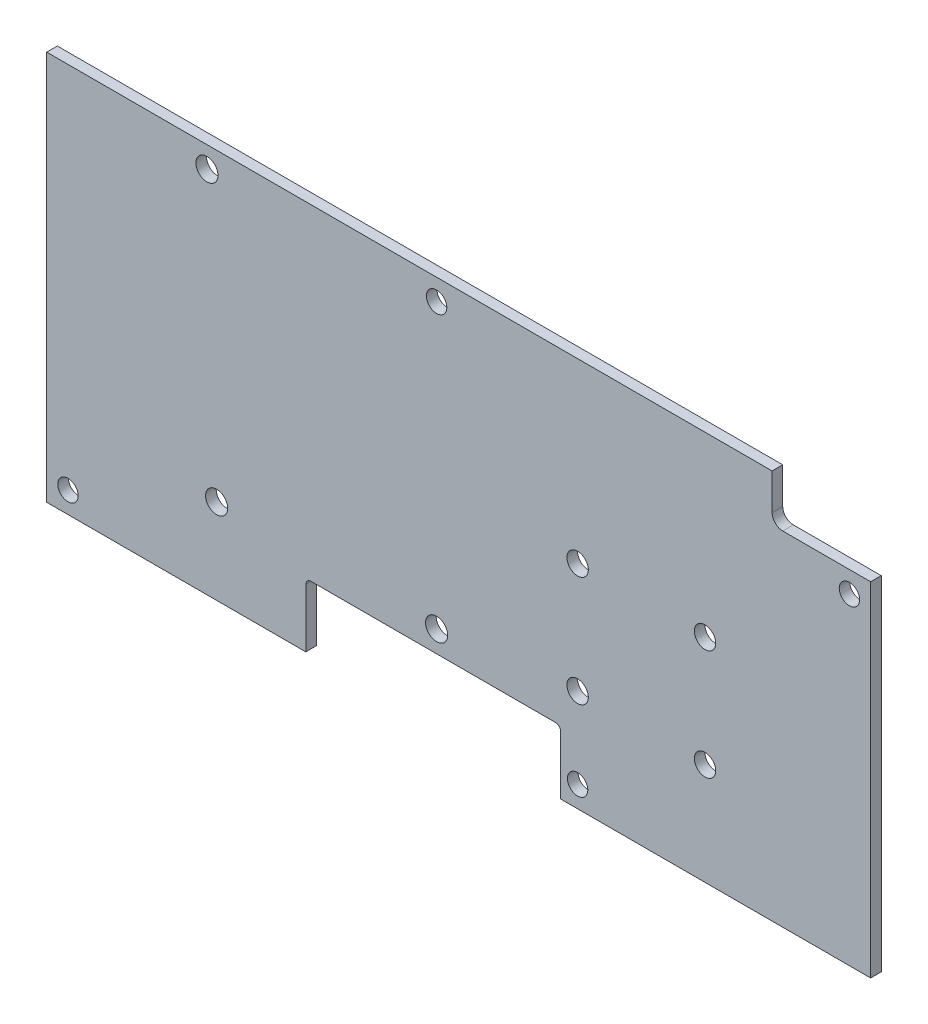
from build123d import *

# Parameters (mm, degrees)
SKETCH1_W               = 167.64
SKETCH1_H               = 165.1
PCB_DEPTH               = 1.5875
SKETCH4_R               = 1.524
MOUNT_HOLES_DEPTH       = 3.175
SKETCH5_W               = 12.7
SKETCH5_H               = 34.29
F_20PINMICROFIT_DEPTH   = 7.62
SKETCH6_W               = 12.7
SKETCH6_H               = 20.32
SBERIBBON_DEPTH         = 9.144
SKETCH7_W               = 12.7
SKETCH7_H               = 10.16
F_4PINMICROFIT_DEPTH    = 7.62
SKETCH8_W               = 10.16
SKETCH8_H               = 10.16
F_2PINMICROFIT_DEPTH    = 5.08
SKETCH9_R               = 1.524
HYD_BOARD_HOLES_DEPTH   = 10.16
SKETCH10_R              = 1.524
SBD_MOUNT_HOLES_DEPTH   = 5.588
SKETCH11_R              = 1.524
GPS_MOUNT_HOLES_DEPTH   = 5.588
SKETCH12_W              = 15.748
SKETCH12_H              = 5.08
SBD_CONN_DEPTH          = 9.906
SKETCH13_W              = 13.97
SKETCH13_H              = 12.7
COMPASS_CONN_DEPTH      = 6.35
SKETCH14_W              = 12.7
SKETCH14_H              = 20.32
ROLL_CONN_DEPTH         = 8.89
SKETCH15_W              = 12.7
SKETCH15_H              = 20.32
PITCH_CONN_DEPTH        = 8.89
CUT_EXTRUDE2_DEPTH      = 236.570117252
CUT_EXTRUDE2_DEPTH_BACK = 236.570117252
SKETCH16_OUTSIDE_W      = 216.878
SKETCH16_OUTSIDE_H      = 214.338
SKETCH16_OUTSIDE_W_2    = 123.19
SKETCH16_OUTSIDE_H_2    = 58.293
SKETCH17_W              = 9.341718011
SKETCH17_H              = 22.065782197
CUT_EXTRUDE3_DEPTH      = 183.917963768
SKETCH18_W              = 17.59156159
SKETCH18_H              = 11.459441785
CUT_EXTRUDE4_DEPTH      = 183.708701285
FILLET1_R               = 1.5875
SKETCH19_R              = 1.651
ISFET_HOLES_DEPTH       = 183.708701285
SKETCH20_R              = 1.6002
CUT_EXTRUDE6_DEPTH      = 183.708701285
SKETCH21_W              = 38.1
SKETCH21_H              = 11.546219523
CUT_EXTRUDE7_DEPTH      = 183.708701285
FILLET2_R               = 0.79375


with BuildPart() as part:
    # Sketch1 → pcb (new body)
    with BuildSketch(Plane.XY):
        with Locations((83.82, 82.55)):
            Rectangle(SKETCH1_W, SKETCH1_H)
    extrude(amount=PCB_DEPTH)

    # Sketch4 → mount_holes (cut)
    with BuildSketch(Plane.XY.offset(1.5875)):
        with Locations((162.8775, 95.25)):
            Circle(SKETCH4_R)
        with Locations(Location((162.8775, 69.85, 0), (0, 0, 180))):
            Circle(SKETCH4_R)
        with Locations((163.83, 161.29)):
            Circle(SKETCH4_R)
        with Locations(Location((163.83, 3.81, 0), (0, 0, 180))):
            Circle(SKETCH4_R)
        with Locations((3.81, 161.29)):
            Circle(SKETCH4_R)
        with Locations(Location((3.81, 3.81, 0), (0, 0, 180))):
            Circle(SKETCH4_R)
        with Locations((162.8775, 82.55)):
            Circle(SKETCH4_R)
        with Locations((20.32, 95.25)):
            Circle(SKETCH4_R)
        with Locations((20.32, 82.55)):
            Circle(SKETCH4_R)
        with Locations(Location((20.32, 69.85, 0), (0, 0, 180))):
            Circle(SKETCH4_R)
    extrude(amount=-MOUNT_HOLES_DEPTH, mode=Mode.SUBTRACT)

    # Sketch5 → 20pinMicrofit (add)
    with BuildSketch(Plane.XY.offset(1.5875)):
        with Locations((7.62, 73.025)):
            Rectangle(SKETCH5_W, SKETCH5_H)
    extrude(amount=F_20PINMICROFIT_DEPTH)

    # Sketch6 → sbeRibbon (add)
    with BuildSketch(Plane.XY.offset(1.5875)):
        with Locations((7.62, 43.18)):
            Rectangle(SKETCH6_W, SKETCH6_H)
    extrude(amount=SBERIBBON_DEPTH)

    # Sketch7 → 4pinMicrofit (add)
    with BuildSketch(Plane.XY.offset(1.5875)):
        with Locations((7.62, 25.4)):
            Rectangle(SKETCH7_W, SKETCH7_H)
    extrude(amount=F_4PINMICROFIT_DEPTH)

    # Sketch8 → 2pinMicrofit (add)
    with BuildSketch(Plane.XY.offset(1.5875)):
        with Locations((6.35, 12.7)):
            Rectangle(SKETCH8_W, SKETCH8_H)
    extrude(amount=F_2PINMICROFIT_DEPTH)

    # Sketch9 → hyd_board_holes (cut)
    with BuildSketch(Plane.XY.offset(1.5875)):
        with Locations((27.94, 8.89)):
            Circle(SKETCH9_R)
        with Locations((27.94, 52.07)):
            Circle(SKETCH9_R)
        with Locations((104.14, 52.07)):
            Circle(SKETCH9_R)
        with Locations((104.14, 8.89)):
            Circle(SKETCH9_R)
    extrude(amount=-HYD_BOARD_HOLES_DEPTH, mode=Mode.SUBTRACT)

    # Sketch10 → sbd_mount_holes (cut)
    with BuildSketch(Plane.XY.offset(1.5875)):
        with Locations((144.78, 161.29)):
            Circle(SKETCH10_R)
        with Locations((83.058, 154.305)):
            Circle(SKETCH10_R)
        with Locations((14.732, 153.035)):
            Circle(SKETCH10_R)
        with Locations(Location((144.78, 97.028, 0), (0, 0, 180))):
            Circle(SKETCH10_R)
        with Locations(Location((83.058, 104.013, 0), (0, 0, 180))):
            Circle(SKETCH10_R)
        with Locations(Location((14.732, 105.283, 0), (0, 0, 180))):
            Circle(SKETCH10_R)
    extrude(amount=-SBD_MOUNT_HOLES_DEPTH, mode=Mode.SUBTRACT)

    # Sketch11 → gps_mount_holes (cut)
    with BuildSketch(Plane.XY.offset(1.5875)):
        with Locations((63.5, 146.05)):
            Circle(SKETCH11_R)
        with Locations((127, 152.4)):
            Circle(SKETCH11_R)
        with Locations((63.5, 120.65)):
            Circle(SKETCH11_R)
        with Locations(Location((127, 114.3, 0), (0, 0, 180))):
            Circle(SKETCH11_R)
    extrude(amount=-GPS_MOUNT_HOLES_DEPTH, mode=Mode.SUBTRACT)

    # Sketch12 → sbd_conn (add)
    with BuildSketch(Plane(origin=(0, 0, 0), x_dir=(-1, 0, 0), z_dir=(0, 0, -1))):
        with Locations((-129.286, 160.655)):
            Rectangle(SKETCH12_W, SKETCH12_H)
    extrude(amount=SBD_CONN_DEPTH)

    # Sketch13 → compass_conn (add)
    with BuildSketch(Plane(origin=(0, 0, 0), x_dir=(-1, 0, 0), z_dir=(0, 0, -1))):
        with Locations((-154.305, 13.97)):
            Rectangle(SKETCH13_W, SKETCH13_H)
    extrude(amount=COMPASS_CONN_DEPTH)

    # Sketch14 → roll_conn (add)
    with BuildSketch(Plane(origin=(0, 0, 0), x_dir=(-1, 0, 0), z_dir=(0, 0, -1))):
        with Locations((-152.4, 31.75)):
            Rectangle(SKETCH14_W, SKETCH14_H)
    extrude(amount=ROLL_CONN_DEPTH)

    # Sketch15 → pitch_conn (add)
    with BuildSketch(Plane(origin=(0, 0, 0), x_dir=(-1, 0, 0), z_dir=(0, 0, -1))):
        with Locations((-152.4, 53.34)):
            Rectangle(SKETCH15_W, SKETCH15_H)
    extrude(amount=PITCH_CONN_DEPTH)

    # Sketch16 outside → Cut-Extrude2 (cut, two sides: drawn at the far end of the back side and taken through both)
    with BuildSketch(Plane.XY.offset(1.5875).offset(-CUT_EXTRUDE2_DEPTH_BACK)):
        with Locations((83.82, 82.55)):
            Rectangle(SKETCH16_OUTSIDE_W, SKETCH16_OUTSIDE_H)
        with Locations((86.36, 78.0415)):
            Rectangle(SKETCH16_OUTSIDE_W_2, SKETCH16_OUTSIDE_H_2, mode=Mode.SUBTRACT)
    extrude(amount=CUT_EXTRUDE2_DEPTH + CUT_EXTRUDE2_DEPTH_BACK, mode=Mode.SUBTRACT)

    # Sketch17 → Cut-Extrude3 (cut, through all)
    with BuildSketch(Plane(origin=(0, 0, 0), x_dir=(-1, 0, 0), z_dir=(0, 0, -1))):
        with Locations((-148.342038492, 54.93009603)):
            Rectangle(SKETCH17_W, SKETCH17_H)
    extrude(amount=CUT_EXTRUDE3_DEPTH, mode=Mode.SUBTRACT)

    # Sketch18 → Cut-Extrude4 (cut, through all)
    with BuildSketch(Plane.XY.offset(1.5875)):
        with Locations((142.018780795, 105.932720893)):
            Rectangle(SKETCH18_W, SKETCH18_H)
    extrude(amount=-CUT_EXTRUDE4_DEPTH, mode=Mode.SUBTRACT)

    # Fillet1
    fillet1_edges = [part.edges().sort_by_distance(p)[0] for p in [
        (133.223, 100.203, 0.79375),
    ]]
    fillet(fillet1_edges, radius=FILLET1_R)

    # Sketch19 → isfet holes (cut, through all)
    with BuildSketch(Plane.XY.offset(1.5875)):
        with Locations((48.7172, 104.013)):
            Circle(SKETCH19_R)
        with Locations((50.165, 61.6458)):
            Circle(SKETCH19_R)
        with Locations((83.058, 61.6458)):
            Circle(SKETCH19_R)
    extrude(amount=-ISFET_HOLES_DEPTH, mode=Mode.SUBTRACT)

    # Sketch20 → Cut-Extrude6 (cut, through all)
    with BuildSketch(Plane.XY.offset(1.5875)):
        with Locations((104.14, 64.135)):
            Circle(SKETCH20_R)
        with Locations((104.14, 80.645)):
            Circle(SKETCH20_R)
        with Locations((123.19, 64.135)):
            Circle(SKETCH20_R)
        with Locations((123.19, 80.645)):
            Circle(SKETCH20_R)
    extrude(amount=-CUT_EXTRUDE6_DEPTH, mode=Mode.SUBTRACT)

    # Sketch21 → Cut-Extrude7 (cut, through all)
    with BuildSketch(Plane.XY.offset(1.5875)):
        with Locations((82.55, 52.646890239)):
            Rectangle(SKETCH21_W, SKETCH21_H)
    extrude(amount=-CUT_EXTRUDE7_DEPTH, mode=Mode.SUBTRACT)

    # Fillet2
    fillet2_edges = [part.edges().sort_by_distance(p)[0] for p in [
        (101.6, 58.42, 0.79375),
        (63.5, 58.42, 0.79375),
    ]]
    fillet(fillet2_edges, radius=FILLET2_R)


solid = part.part
